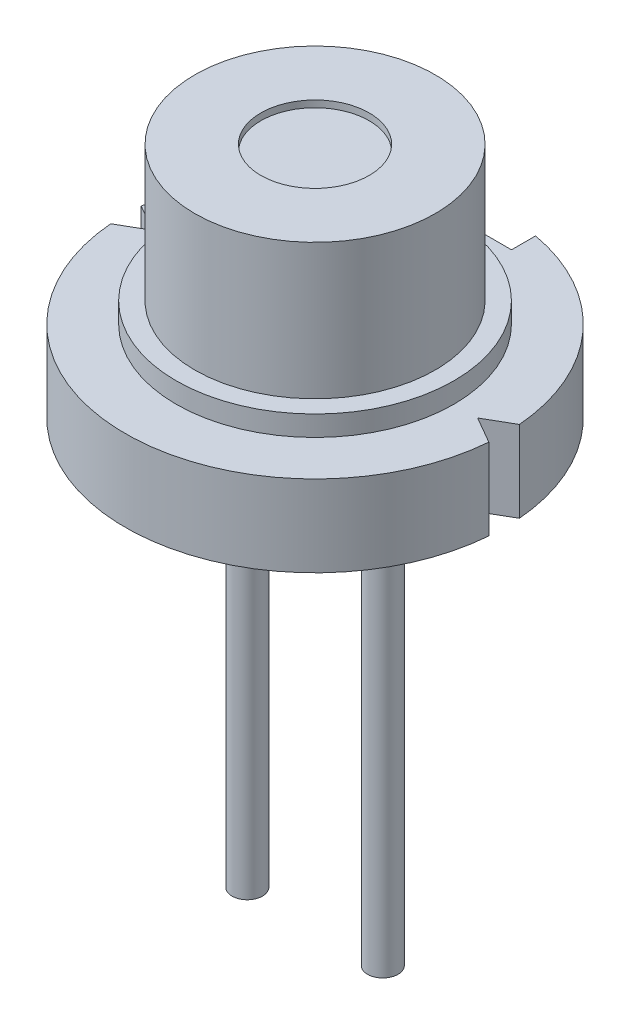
from build123d import *

# Parameters (mm, degrees)
SKETCH_1_R          = 2.8
EXTRUDE_1_DEPTH     = 1.2
SKETCH_2_R          = 2.05
EXTRUDE_2_DEPTH     = 0.3
SKETCH_3_R          = 1.775
EXTRUDE_3_DEPTH     = 2
SKETCH_4_R          = 0.8
CUT_EXTRUDE_1_DEPTH = 0.1
CUT_EXTRUDE_2_DEPTH = 5.579301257
SKETCH_6_R          = 0.225
EXTRUDE_4_DEPTH     = 6.5
FILLET_1_R          = 0.4


with BuildPart() as part:
    # Sketch 1 → Extrude 1 (new body)
    with BuildSketch(Plane(origin=(0, 0, 0), x_dir=(1, 0, 0), z_dir=(0, 1, 0))):
        with Locations(Location((0, 0, 0), (0, 0, 270))):
            Circle(SKETCH_1_R)
    extrude(amount=EXTRUDE_1_DEPTH)

    # Sketch 2 → Extrude 2 (add)
    with BuildSketch(Plane(origin=(0, 1.2, 0), x_dir=(1, 0, 0), z_dir=(0, 1, 0))):
        with Locations(Location((0, 0, 0), (0, 0, 270))):
            Circle(SKETCH_2_R)
    extrude(amount=EXTRUDE_2_DEPTH)

    # Sketch 3 → Extrude 3 (add)
    with BuildSketch(Plane(origin=(0, 1.5, 0), x_dir=(1, 0, 0), z_dir=(0, 1, 0))):
        with Locations(Location((0, 0, 0), (0, 0, 270))):
            Circle(SKETCH_3_R)
    extrude(amount=EXTRUDE_3_DEPTH)

    # Sketch 4 → Cut-Extrude 1 (cut)
    with BuildSketch(Plane(origin=(0, 3.5, 0), x_dir=(1, 0, 0), z_dir=(0, 1, 0))):
        with Locations(Location((0, 0, 0), (0, 0, 270))):
            Circle(SKETCH_4_R)
    extrude(amount=-CUT_EXTRUDE_1_DEPTH, mode=Mode.SUBTRACT)

    # Sketch 5 → Cut-Extrude 2 (cut, through all)
    with BuildSketch(Plane(origin=(0, 1.2, 0), x_dir=(1, 0, 0), z_dir=(0, 1, 0))):
        with BuildLine():
            Line((0.5, 2.4), (0.5, 2.754995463))
            ThreePointArc((0.5, 2.754995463), (0, 2.8), (-0.5, 2.754995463))
            Line((-0.5, 2.754995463), (-0.5, 2.4))
            Line((-0.5, 2.4), (0.5, 2.4))
        make_face()
        with BuildLine():
            Line((-2.4, 0), (-2.79089023, -0.22568058))
            ThreePointArc((-2.79089023, -0.22568058), (-2.8, 0), (-2.79089023, 0.22568058))
            Line((-2.79089023, 0.22568058), (-2.4, 0))
        make_face()
        with BuildLine():
            Line((2.4, 0), (2.79089023, 0.22568058))
            ThreePointArc((2.79089023, 0.22568058), (2.8, 0), (2.79089023, -0.22568058))
            Line((2.79089023, -0.22568058), (2.4, 0))
        make_face()
    extrude(amount=-CUT_EXTRUDE_2_DEPTH, mode=Mode.SUBTRACT)

    # Sketch 6 → Extrude 4 (add)
    with BuildSketch(Plane.XZ):
        with Locations(Location((-1, 0, 0), (0, 0, 90))):
            Circle(SKETCH_6_R)
        with Locations(Location((0, -1, 0), (0, 0, 90))):
            Circle(SKETCH_6_R)
        with Locations(Location((1, 0, 0), (0, 0, 90))):
            Circle(SKETCH_6_R)
    extrude(amount=EXTRUDE_4_DEPTH)

    # Fillet 1
    fillet_1_edges = [part.edges().sort_by_distance(p)[0] for p in [
        (-1, 0, -0.225),
        (0, 0, -1.225),
        (1, 0, -0.225),
    ]]
    fillet(fillet_1_edges, radius=FILLET_1_R)


solid = part.part
